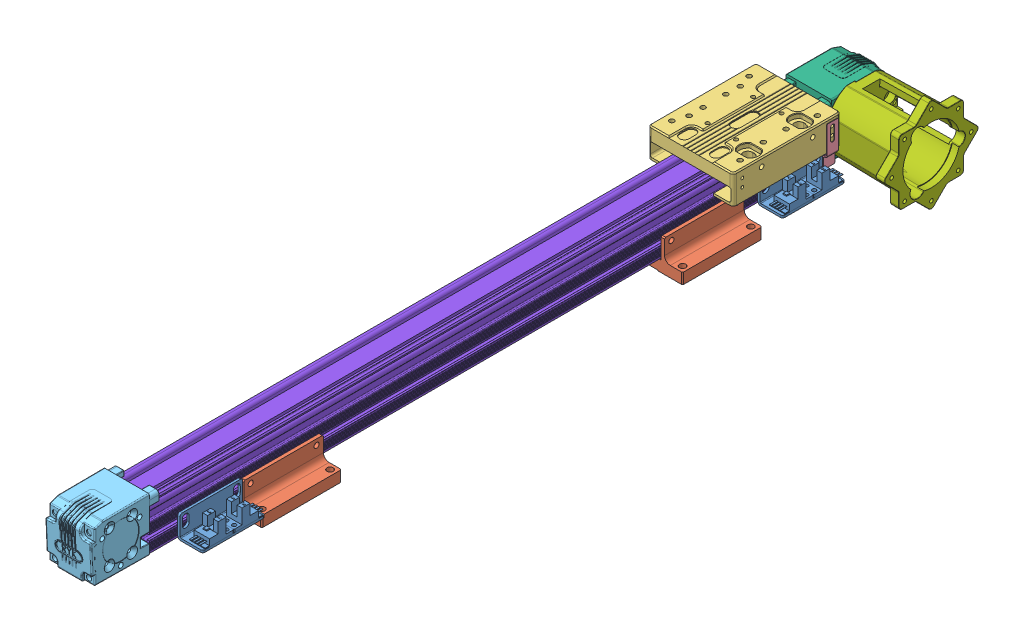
SolidWorks assembly RYK40-直连.SLDASM, configuration 默认 (file format 9000). Lengths in mm.
Overall size (121.8 83.09 719.47).
17 component instances, 12 part files, 49 mates.
Components (placement in the parent):
- 674光电组合-1: 674光电组合.SLDPRT [默认] at (-227.041 122.2519 117.9175) x (-1 0 0) z (0 0 -1) size (22 20 55.4)
- RY40欧规安装座-1: RY40欧规安装座.SLDPRT [默认] at (-213.9872 100.4811 22.0386) size (78 28 70)
- RY40欧规皮带模组滑块-1: RY40欧规皮带模组滑块.SLDPRT [默认] at (-308.9872 151.5884 -400.5946) x (0 0 -1) z (1 0 0) size (95 25.25 75)
- RY40欧规皮带模组感应片-1: RY40欧规皮带模组感应片.SLDPRT [默认] at (-177.0188 158.2814 -440.9614) x (0 0 -1) z (1 0 0) size (10 36 4)
- RYK40-欧规副同步轮座-1: RYK40-欧规副同步轮座.SLDPRT [默认] at (-422.4567 131.0445 -656.4222) x (1 0 0) z (0 0 1) size (40.02 47.72 61.93)
- RYK40-欧规主同步轮座-1A出轴-1: RYK40-欧规主同步轮座-1A出轴.SLDPRT [默认] at (-422.4567 131.0445 -856.4222) size (66.71 47.71 61.93)
- 57-60电机座-1: 57-60电机座.SLDPRT [默认] at (-191.0872 133.9811 -487.9614) x (0 1 0) z (1 0 0) size (83.09 83.08 62.81)
- RYK40-欧规主同步轮座-2B出轴-1: RYK40-欧规主同步轮座-2B出轴.SLDPRT [默认] at (-422.4567 131.0445 -856.4222) (suppressed, hidden)
- 57-60电机座-2: 57-60电机座.SLDPRT [默认] at (-236.8872 133.9811 -487.9614) x (0 1 0) z (-1 0 0) size (83.09 83.08 62.81) (suppressed, hidden)
- RYK40-欧规主同步轮座-双出轴-1: RYK40-欧规主同步轮座-双出轴.SLDPRT [默认] at (-422.4567 131.0445 -856.4222) (suppressed, hidden)
- 57-60电机座-3: 57-60电机座.SLDPRT [默认] at (-236.8872 133.9811 -487.9614) x (0 1 0) z (-1 0 0) size (83.09 83.08 62.81) (suppressed, hidden)
- 57-60电机座-4: 57-60电机座.SLDPRT [默认] at (-191.2872 133.9811 -487.9614) x (0 1 0) z (1 0 0) size (83.09 83.08 62.81) (suppressed, hidden)
- RYK40型材底座-1: RYK40型材底座.SLDPRT [默认] at (-336.2336 6.9378 -462.9614) size (40 39 600)
- RY40欧规安装座-2: RY40欧规安装座.SLDPRT [默认] at (-213.9872 100.4811 -347.9614) size (78 28 70)
- 674光电组合-2: 674光电组合.SLDPRT [默认] at (-227.041 122.2519 627.9175) x (-1 0 0) z (0 0 -1) size (22 20 55.4)
- 750W电机标准转接板-1: 750W电机标准转接板.SLDPRT [默认] at (-131.1872 133.9811 -487.9614) x (0 -1 0) z (0 0 1) (suppressed, hidden)
- 86电机转接板-M5-1: 86电机转接板-M5.SLDPRT [默认] at (-131.1872 133.9811 -487.9614) x (0 0 -1) z (1 0 0) (suppressed, hidden)
Mates (geometry in assembly coordinates):
- 重合11: coincident anti-aligned: plane of RYK40-欧规主同步轮座-1A出轴-1 through (-230.9872 151.9811 -462.9614) normal (0 0 1); plane of RYK40型材底座-1 through (-336.2336 6.9378 -462.9614) normal (0 0 -1)
- 重合12: coincident aligned: plane of RYK40-欧规主同步轮座-1A出轴-1 through (-195.4872 109.9811 -462.9614) normal (0 -1 0); plane of RYK40型材底座-1 through (-336.2336 109.9811 137.0386) normal (0 -1 0)
- 宽度4: width aligned: plane of RYK40型材底座-1 through (-233.9872 6.9378 137.0386) normal (-1 0 0); plane of RYK40型材底座-1 through (-193.9872 6.9378 137.0386) normal (1 0 0); plane of RYK40-欧规主同步轮座-1A出轴-1 through (-233.9872 151.9811 -462.9614) normal (-1 0 0); plane of RYK40-欧规主同步轮座-1A出轴-1 through (-193.9872 151.9811 -462.9614) normal (1 0 0)
- 重合13: coincident anti-aligned: plane of RYK40-欧规主同步轮座-2B出轴-1 through (-230.9872 151.9811 -462.9614) normal (0 0 1); plane of RYK40型材底座-1 through (-336.2336 6.9378 -462.9614) normal (0 0 -1)
- 重合14: coincident aligned: plane of RYK40-欧规主同步轮座-2B出轴-1 through (-195.4872 109.9811 -462.9614) normal (0 -1 0); plane of RYK40型材底座-1 through (-336.2336 109.9811 137.0386) normal (0 -1 0)
- 宽度6: width aligned: plane of RYK40型材底座-1 through (-233.9872 6.9378 137.0386) normal (-1 0 0); plane of RYK40型材底座-1 through (-193.9872 6.9378 137.0386) normal (1 0 0); plane of RYK40-欧规主同步轮座-2B出轴-1 through (-233.9872 151.9811 -462.9614) normal (-1 0 0); plane of RYK40-欧规主同步轮座-2B出轴-1 through (-193.9872 151.9811 -462.9614) normal (1 0 0)
- 重合15: coincident anti-aligned: plane of RYK40-欧规副同步轮座-1 through (-193.7472 109.9811 137.0386) normal (0 0 -1); plane of RYK40型材底座-1 through (-336.2336 6.9378 137.0386) normal (0 0 1)
- 重合21: coincident aligned: plane of RYK40-欧规副同步轮座-1 through (-193.9872 146.9811 129.5386) normal (1 0 0); plane of RYK40-欧规主同步轮座-2B出轴-1 through (-193.9872 146.9811 -455.4614) normal (1 0 0)
- 宽度11: width aligned: plane of RY40欧规皮带模组滑块-1 through (-176.4872 161.2811 -358.9614) normal (1 0 0); plane of RY40欧规皮带模组滑块-1 through (-251.4872 161.2811 -358.9614) normal (-1 0 0); plane of RYK40型材底座-1 through (-193.9872 6.9378 137.0386) normal (1 0 0); plane of RYK40型材底座-1 through (-233.9872 6.9378 137.0386) normal (-1 0 0)
- 重合26: coincident anti-aligned: plane of RY40欧规皮带模组滑块-1 through (-251.4872 161.2811 -453.9614) normal (0 0 -1); plane of RYK40-欧规主同步轮座-1A出轴-1 through (-230.4872 151.4811 -453.9614) normal (0 0 1)
- 重合30: coincident anti-aligned: plane of 674光电组合-1 through (-193.9872 129.9811 -452.9614) normal (-1 0 0); plane of RYK40型材底座-1 through (-193.9872 6.9378 137.0386) normal (1 0 0)
- 重合31: coincident aligned: plane of 674光电组合-1 through (-193.9872 109.9811 -452.9614) normal (0 -1 0); plane of RYK40型材底座-1 through (-336.2336 109.9811 137.0386) normal (0 -1 0)
- 距离5: distance = 10 mm aligned: plane of 674光电组合-1 through (-191.9872 112.7177 -452.9614) normal (0 0 -1); plane of RYK40型材底座-1 through (-336.2336 6.9378 -462.9614) normal (0 0 -1)
- 重合35: coincident anti-aligned: plane of RYK40型材底座-1 through (-193.9872 6.9378 137.0386) normal (1 0 0); plane of 674光电组合-2 through (-193.9872 129.9811 57.0386) normal (-1 0 0)
- 距离6: distance = 25 mm aligned: plane of 674光电组合-2 through (-191.2506 112.7177 112.0386) normal (0 0 1); plane of RYK40型材底座-1 through (-336.2336 6.9378 137.0386) normal (0 0 1)
- 重合37: coincident aligned: plane of 674光电组合-1 through (-193.9872 109.9811 -452.9614) normal (0 -1 0); plane of 674光电组合-2 through (-193.9872 109.9811 57.0386) normal (0 -1 0)
- 同心1: concentric aligned: cylinder of RY40欧规皮带模组滑块-1 through (-176.4872 154.2814 -445.9614) axis (1 0 0) radius 1.25; cylinder of RY40欧规皮带模组感应片-1 through (-180.0188 154.2814 -445.9614) axis (1 0 0) radius 1.75
- 同心2: concentric aligned: cylinder of RYK40-欧规主同步轮座-1A出轴-1 through (-230.8372 133.9811 -487.9614) axis (1 0 0) radius 6; cone of 57-60电机座-1 through (-184.0872 133.9811 -487.9614) axis (1 0 0)
- 重合38: coincident anti-aligned: plane of RYK40-欧规主同步轮座-1A出轴-1 through (-193.9872 151.9811 -462.9614) normal (1 0 0); plane of 57-60电机座-1 through (-193.9872 133.9811 -487.9614) normal (-1 0 0)
- 同心3: concentric anti-aligned: cylinder of RYK40-欧规主同步轮座-1A出轴-1 through (-193.9872 114.9811 -487.9614) axis (1 0 0) radius 2.1; cone of 57-60电机座-1 through (-194.0872 114.9811 -487.9614) axis (-1 0 0)
- 同心6: concentric aligned: cylinder of 57-60电机座-1 through (-137.0872 133.9811 -487.9614) axis (1 0 0) radius 25; cylinder of 86电机转接板-M5-1 through (-133.1872 133.9811 -487.9614) axis (1 0 0) radius 25
- 重合40: coincident anti-aligned: plane of 57-60电机座-1 through (-131.1872 133.9811 -487.9614) normal (1 0 0); plane of 86电机转接板-M5-1 through (-131.1872 93.9811 -527.9614) normal (-1 0 0)
- 重合41: coincident anti-aligned: plane of 57-60电机座-1 through (-131.1872 133.9811 -487.9614) normal (1 0 0); plane of 750W电机标准转接板-1 through (-131.1872 133.9811 -487.9614) normal (-1 0 0)
- 同心8: concentric aligned: cylinder of 57-60电机座-1 through (-137.0872 133.9811 -487.9614) axis (1 0 0) radius 25; cylinder of 750W电机标准转接板-1 through (-133.1872 133.9811 -487.9614) axis (1 0 0) radius 25
- 平行1: parallel aligned: plane of RY40欧规皮带模组滑块-1 through (-213.9872 161.2811 -406.4614) normal (0 1 0); plane of 750W电机标准转接板-1 through (-119.1872 173.9811 -527.9614) normal (0 1 0)
- 平行2: parallel aligned: plane of RY40欧规皮带模组滑块-1 through (-213.9872 161.2811 -406.4614) normal (0 1 0); plane of 86电机转接板-M5-1 through (-119.1872 176.9811 -447.9614) normal (0 1 0)
- 重合42: coincident anti-aligned: plane of RY40欧规皮带模组滑块-1 through (-251.4872 161.2811 -453.9614) normal (0 0 -1); plane of RYK40-欧规主同步轮座-2B出轴-1 through (-230.4872 151.4811 -453.9614) normal (0 0 1)
- 同心9: concentric aligned: cylinder of RYK40-欧规主同步轮座-2B出轴-1 through (-196.3872 133.9811 -487.9614) axis (-1 0 0) radius 6; cone of 57-60电机座-2 through (-243.8872 133.9811 -487.9614) axis (-1 0 0)
- 重合43: coincident anti-aligned: plane of RYK40-欧规主同步轮座-2B出轴-1 through (-233.9872 151.9811 -462.9614) normal (-1 0 0); plane of 57-60电机座-2 through (-233.9872 133.9811 -487.9614) normal (1 0 0)
- 同心10: concentric anti-aligned: cylinder of RYK40-欧规主同步轮座-2B出轴-1 through (-233.9872 143.4811 -504.4159) axis (-1 0 0) radius 2.1; cone of 57-60电机座-2 through (-233.8872 143.4811 -504.4159) axis (1 0 0)
- 同心11: concentric aligned: cylinder of RYK40-欧规主同步轮座-双出轴-1 through (-196.3872 133.9811 -487.9614) axis (-1 0 0) radius 6; cone of 57-60电机座-3 through (-243.8872 133.9811 -487.9614) axis (-1 0 0)
- 重合44: coincident anti-aligned: plane of RYK40-欧规主同步轮座-双出轴-1 through (-233.9872 151.9811 -462.9614) normal (-1 0 0); plane of 57-60电机座-3 through (-233.9872 133.9811 -487.9614) normal (1 0 0)
- 同心12: concentric anti-aligned: cylinder of RYK40-欧规主同步轮座-双出轴-1 through (-233.9872 114.9811 -487.9614) axis (-1 0 0) radius 2.1; cone of 57-60电机座-3 through (-233.8872 114.9811 -487.9614) axis (1 0 0)
- 重合45: coincident anti-aligned: plane of RYK40-欧规主同步轮座-双出轴-1 through (-194.1872 133.9811 -487.9614) normal (1 0 0); plane of 57-60电机座-4 through (-194.1872 133.9811 -487.9614) normal (-1 0 0)
- 同心13: concentric aligned: cylinder of RYK40-欧规主同步轮座-双出轴-1 through (-230.8372 133.9811 -487.9614) axis (1 0 0) radius 6; cone of 57-60电机座-4 through (-184.2872 133.9811 -487.9614) axis (1 0 0)
- 同心14: concentric anti-aligned: cylinder of RYK40-欧规主同步轮座-双出轴-1 through (-193.9872 143.4811 -471.5069) axis (1 0 0) radius 2.1; cone of 57-60电机座-4 through (-194.2872 143.4811 -471.5069) axis (-1 0 0)
- 重合46: coincident anti-aligned: plane of RYK40-欧规主同步轮座-双出轴-1 through (-230.9872 151.9811 -462.9614) normal (0 0 1); plane of RYK40型材底座-1 through (-336.2336 6.9378 -462.9614) normal (0 0 -1)
- 重合47: coincident aligned: plane of RYK40-欧规主同步轮座-双出轴-1 through (-195.4872 109.9811 -462.9614) normal (0 -1 0); plane of RYK40型材底座-1 through (-336.2336 109.9811 137.0386) normal (0 -1 0)
- 宽度13: width aligned: plane of RYK40-欧规主同步轮座-双出轴-1 through (-193.9872 151.9811 -462.9614) normal (1 0 0); plane of RYK40-欧规主同步轮座-双出轴-1 through (-233.9872 151.9811 -462.9614) normal (-1 0 0); plane of RYK40型材底座-1 through (-193.9872 6.9378 137.0386) normal (1 0 0); plane of RYK40型材底座-1 through (-233.9872 6.9378 137.0386) normal (-1 0 0)
- 重合48: coincident anti-aligned: plane of RY40欧规皮带模组滑块-1 through (-251.4872 161.2811 -453.9614) normal (0 0 -1); plane of RYK40-欧规主同步轮座-双出轴-1 through (-197.2372 148.4915 -453.9614) normal (0 0 1)
- 宽度14: width aligned: plane of RY40欧规安装座-2 through (-193.8372 123.4811 -317.9614) normal (-1 0 0); plane of RY40欧规安装座-2 through (-234.1372 123.4811 -377.9614) normal (1 0 0); plane of RYK40型材底座-1 through (-233.9872 6.9378 137.0386) normal (-1 0 0); plane of RYK40型材底座-1 through (-193.9872 6.9378 137.0386) normal (1 0 0)
- 重合49: coincident anti-aligned: plane of RYK40型材底座-1 through (-336.2336 109.9811 137.0386) normal (0 -1 0); plane of RY40欧规安装座-2 through (-213.9872 109.9811 -347.9614) normal (0 1 0)
- 距离7: distance = 80 mm aligned: plane of RYK40型材底座-1 through (-336.2336 6.9378 -462.9614) normal (0 0 -1); plane of RY40欧规安装座-2 through (-252.9872 109.9811 -382.9614) normal (0 0 -1)
- 宽度15: width aligned: plane of RY40欧规安装座-1 through (-193.8372 123.4811 52.0386) normal (-1 0 0); plane of RY40欧规安装座-1 through (-234.1372 123.4811 -7.9614) normal (1 0 0); plane of RYK40型材底座-1 through (-233.9872 6.9378 137.0386) normal (-1 0 0); plane of RYK40型材底座-1 through (-193.9872 6.9378 137.0386) normal (1 0 0)
- 重合51: coincident anti-aligned: plane of RY40欧规安装座-1 through (-213.9872 109.9811 22.0386) normal (0 1 0); plane of RYK40型材底座-1 through (-336.2336 109.9811 137.0386) normal (0 -1 0)
- 距离8: distance = 80 mm aligned: plane of RY40欧规安装座-1 through (-252.9872 109.9811 57.0386) normal (0 0 1); plane of RYK40型材底座-1 through (-336.2336 6.9378 137.0386) normal (0 0 1)
- 同心15: concentric anti-aligned: cylinder of RYK40-欧规副同步轮座-1 through (-229.9872 143.9811 140.0386) axis (0 0 -1) radius 3.25; cylinder of RYK40型材底座-1 through (-229.9872 143.9811 -471.4467) axis (0 0 1) radius 3
- 同心16: concentric anti-aligned: cylinder of RYK40-欧规副同步轮座-1 through (-197.9872 143.9811 140.0386) axis (0 0 -1) radius 3.25; cylinder of RYK40型材底座-1 through (-197.9872 143.9811 -471.4467) axis (0 0 1) radius 3
- 距离10: distance = 60.8 mm anti-aligned: plane of RY40欧规皮带模组滑块-1 through (-213.9872 161.2811 -406.4614) normal (0 1 0); plane of RY40欧规安装座-2 through (-213.9872 100.4811 -347.9614) normal (0 -1 0)
